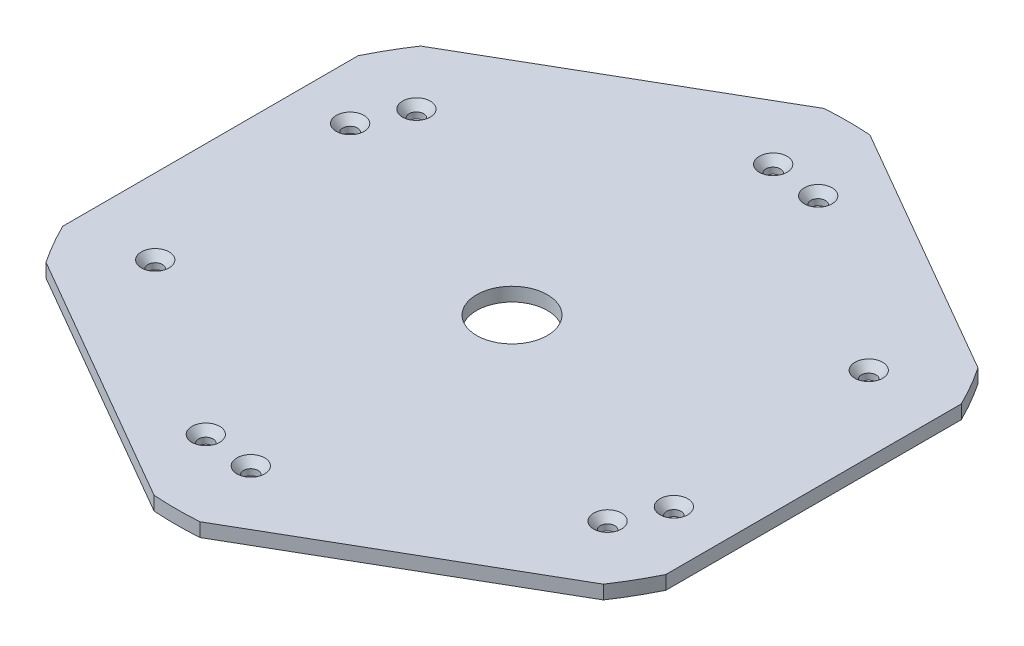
from build123d import *

# Parameters (mm, degrees)
SKETCH1_R          = 155.575
EXTRUDE1_DEPTH     = 6.35
SKETCH2_R          = 16.383
CUT_EXTRUDE1_DEPTH = 6.35
CIRPATTERN1_COUNT  = 6
CUT_EXTRUDE2_DEPTH = 221.107891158
CIRPATTERN2_COUNT  = 6
LPATTERN1_COUNT    = 2
LPATTERN1_PITCH    = 158.75


with BuildPart() as part:
    # Sketch1 → Extrude1 (new body)
    with BuildSketch(Plane(origin=(0, 0, 0), x_dir=(1, 0, 0), z_dir=(0, 1, 0))):
        with Locations(Location((0, 0, 0), (0, 0, 270))):
            Circle(SKETCH1_R)
    extrude(amount=EXTRUDE1_DEPTH)

    # Sketch2 → Cut-Extrude1 (cut)
    with BuildSketch(Plane(origin=(0, 6.35, 0), x_dir=(-1, 0, 0), z_dir=(0, 1, 0))):
        with Locations(Location((0, 0, 0), (0, 0, 90))):
            Circle(SKETCH2_R)
    extrude(amount=-CUT_EXTRUDE1_DEPTH, mode=Mode.SUBTRACT)

    # Sketch3 → CSK for 1_4 Flat Head Machine Screw3 (revolve, cut)
    with BuildSketch(Plane(origin=(0, 6.35, -121.0056), x_dir=(0, 0, 1), z_dir=(1, 0, 0))):
        Polygon((0, 0), (0, 6.35), (3.3782, 6.35), (3.3782, 3.520932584), (6.4389, 0), align=None)
    csk_for_1_4_flat_head_machine_screw3 = revolve(axis=Axis((0, 12.7, -121.0056), (0, -1, 0)), mode=Mode.SUBTRACT)

    # CirPattern1: CSK for 1_4 Flat Head Machine Screw3 ×6 about axis
    cirpattern1_axis = Axis((0, 0, 0), (0, 1, 0))
    for i in range(1, CIRPATTERN1_COUNT):
        add(csk_for_1_4_flat_head_machine_screw3.rotate(cirpattern1_axis, i * 360 / CIRPATTERN1_COUNT), mode=Mode.SUBTRACT)

    # Sketch4 → Cut-Extrude2 (cut, through all)
    with BuildSketch(Plane(origin=(0, 6.35, 0), x_dir=(-1, 0, 0), z_dir=(0, 1, 0))):
        with BuildLine():
            Line((31.040472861, 179.254741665), (-181.709731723, 56.423353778))
            ThreePointArc((-181.709731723, 56.423353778), (-99.239182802, 159.242948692), (31.040472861, 179.254741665))
        make_face()
    cut_extrude2 = extrude(amount=-CUT_EXTRUDE2_DEPTH, mode=Mode.SUBTRACT)

    # CirPattern2: Cut-Extrude2 ×6 about axis
    cirpattern2_axis = Axis((0, 0, 0), (0, 1, 0))
    for i in range(1, CIRPATTERN2_COUNT):
        add(cut_extrude2.rotate(cirpattern2_axis, i * 360 / CIRPATTERN2_COUNT), mode=Mode.SUBTRACT)

    # Sketch5 → CSK for 1_4 Flat Head Machine Screw1 (revolve, cut)
    with BuildSketch(Plane(origin=(23.073588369, 6.35, -118.785372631), x_dir=(0, 0, 1), z_dir=(1, 0, 0))):
        Polygon((0, 0), (0, 6.35), (3.3782, 6.35), (3.3782, 3.520932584), (6.4389, 0), align=None)
    csk_for_1_4_flat_head_machine_screw1 = revolve(axis=Axis((23.073588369, 12.7, -118.785372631), (0, -1, 0)), mode=Mode.SUBTRACT)

    # Sketch6 → CSK for 1_4 Flat Head Machine Screw2 (revolve, cut)
    with BuildSketch(Plane(origin=(114.407944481, 6.35, 39.410372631), x_dir=(0, 0, 1), z_dir=(1, 0, 0))):
        Polygon((0, 0), (0, 6.35), (3.3782, 6.35), (3.3782, 3.520932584), (6.4389, 0), align=None)
    csk_for_1_4_flat_head_machine_screw2 = revolve(axis=Axis((114.407944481, 12.7, 39.410372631), (0, -1, 0)), mode=Mode.SUBTRACT)

    # LPattern1: CSK for 1_4 Flat Head Machine Screw1, CSK for 1_4 Flat Head Machine Screw2 ×2
    with Locations(*[Vector(-0.8660254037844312, 0, 0.5000000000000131) * (i * LPATTERN1_PITCH) for i in range(1, LPATTERN1_COUNT)]):
        add(csk_for_1_4_flat_head_machine_screw1, mode=Mode.SUBTRACT)
        add(csk_for_1_4_flat_head_machine_screw2, mode=Mode.SUBTRACT)


solid = part.part
